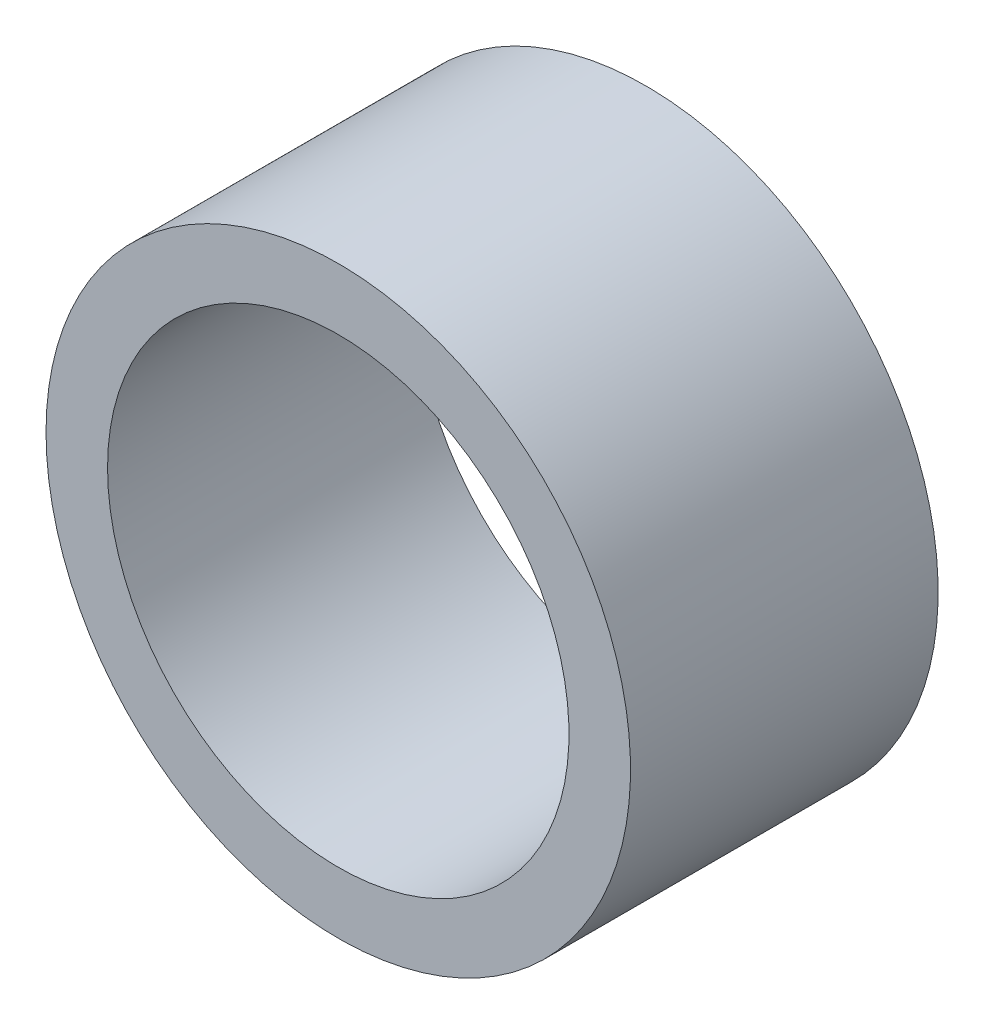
from build123d import *

# Parameters (mm, degrees)
ESQUISSE1_R          = 19
ESQUISSE1_R_2        = 15
BASE_EXTRUSION_DEPTH = 10


with BuildPart() as part:
    # Esquisse1 → Base-Extrusion (new, symmetric)
    with BuildSketch(Plane.XY):
        Circle(ESQUISSE1_R)
        Circle(ESQUISSE1_R_2, mode=Mode.SUBTRACT)
    extrude(amount=BASE_EXTRUSION_DEPTH, both=True)


solid = part.part
